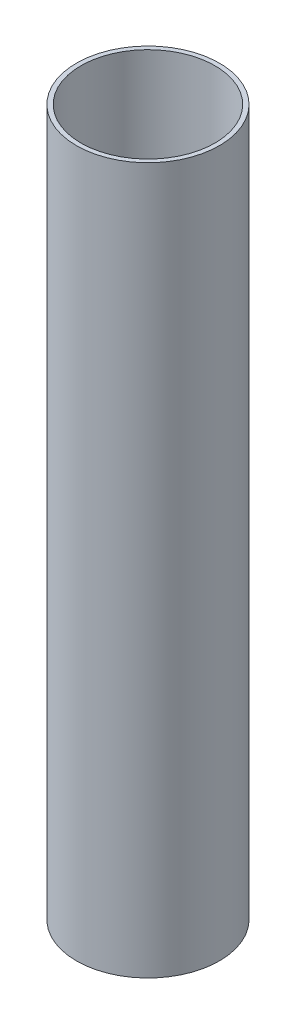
ISO-10303-21;
HEADER;
FILE_DESCRIPTION(('STEP AP214'),'2;1');
FILE_NAME('part.step','',(''),(''),'','','');
FILE_SCHEMA(('AUTOMOTIVE_DESIGN { 1 0 10303 214 1 1 1 1 }'));
ENDSEC;
DATA;
#1=APPLICATION_CONTEXT('core data for automotive mechanical design processes');
#2=APPLICATION_PROTOCOL_DEFINITION('international standard','automotive_design',2000,#1);
#3=PRODUCT_CONTEXT('',#1,'mechanical');
#4=PRODUCT('Part','Part','',(#3));
#5=PRODUCT_RELATED_PRODUCT_CATEGORY('part','',(#4));
#6=PRODUCT_DEFINITION_FORMATION('','',#4);
#7=PRODUCT_DEFINITION_CONTEXT('part definition',#1,'design');
#8=PRODUCT_DEFINITION('design','',#6,#7);
#9=PRODUCT_DEFINITION_SHAPE('','',#8);
#10=(LENGTH_UNIT() NAMED_UNIT(*) SI_UNIT(.MILLI.,.METRE.));
#11=(NAMED_UNIT(*) PLANE_ANGLE_UNIT() SI_UNIT($,.RADIAN.));
#12=(NAMED_UNIT(*) SI_UNIT($,.STERADIAN.) SOLID_ANGLE_UNIT());
#13=UNCERTAINTY_MEASURE_WITH_UNIT(LENGTH_MEASURE(1.E-05),#10,'distance_accuracy_value','');
#14=(GEOMETRIC_REPRESENTATION_CONTEXT(3) GLOBAL_UNCERTAINTY_ASSIGNED_CONTEXT((#13)) GLOBAL_UNIT_ASSIGNED_CONTEXT((#10,
#11,#12)) REPRESENTATION_CONTEXT('',''));
#15=CARTESIAN_POINT('',(0.,0.,0.));
#16=DIRECTION('',(0.,0.,1.));
#17=DIRECTION('',(1.,0.,0.));
#18=AXIS2_PLACEMENT_3D('',#15,#16,#17);
#19=CARTESIAN_POINT('',(0.,-501.65,0.));
#20=DIRECTION('',(0.,1.,0.));
#21=DIRECTION('',(0.,0.,1.));
#22=AXIS2_PLACEMENT_3D('',#19,#20,#21);
#23=CYLINDRICAL_SURFACE('',#22,50.8);
#24=CARTESIAN_POINT('',(0.,-501.65,0.));
#25=DIRECTION('',(0.,1.,0.));
#26=DIRECTION('',(0.,0.,1.));
#27=AXIS2_PLACEMENT_3D('',#24,#25,#26);
#28=CIRCLE('',#27,50.8);
#29=CARTESIAN_POINT('',(0.,-501.65,50.8));
#30=VERTEX_POINT('',#29);
#31=EDGE_CURVE('E10',#30,#30,#28,.T.);
#32=ORIENTED_EDGE('',*,*,#31,.T.);
#33=EDGE_LOOP('',(#32));
#34=FACE_BOUND('',#33,.T.);
#35=CARTESIAN_POINT('',(0.,0.,0.));
#36=DIRECTION('',(0.,1.,0.));
#37=DIRECTION('',(0.,0.,1.));
#38=AXIS2_PLACEMENT_3D('',#35,#36,#37);
#39=CIRCLE('',#38,50.8);
#40=CARTESIAN_POINT('',(0.,0.,50.8));
#41=VERTEX_POINT('',#40);
#42=EDGE_CURVE('E36',#41,#41,#39,.T.);
#43=ORIENTED_EDGE('',*,*,#42,.F.);
#44=EDGE_LOOP('',(#43));
#45=FACE_BOUND('',#44,.T.);
#46=ADVANCED_FACE('F30',(#34,#45),#23,.T.);
#47=CARTESIAN_POINT('',(0.,-501.65,0.));
#48=DIRECTION('',(0.,1.,0.));
#49=DIRECTION('',(0.,0.,1.));
#50=AXIS2_PLACEMENT_3D('',#47,#48,#49);
#51=PLANE('',#50);
#52=CARTESIAN_POINT('',(0.,-501.65,0.));
#53=DIRECTION('',(0.,1.,0.));
#54=DIRECTION('',(0.,0.,1.));
#55=AXIS2_PLACEMENT_3D('',#52,#53,#54);
#56=CIRCLE('',#55,47.625);
#57=CARTESIAN_POINT('',(0.,-501.65,47.625));
#58=VERTEX_POINT('',#57);
#59=EDGE_CURVE('E40',#58,#58,#56,.T.);
#60=ORIENTED_EDGE('',*,*,#59,.T.);
#61=EDGE_LOOP('',(#60));
#62=FACE_BOUND('',#61,.T.);
#63=ORIENTED_EDGE('',*,*,#31,.F.);
#64=EDGE_LOOP('',(#63));
#65=FACE_BOUND('',#64,.T.);
#66=ADVANCED_FACE('F54',(#62,#65),#51,.F.);
#67=CARTESIAN_POINT('',(0.,0.,0.));
#68=DIRECTION('',(0.,1.,0.));
#69=DIRECTION('',(0.,0.,1.));
#70=AXIS2_PLACEMENT_3D('',#67,#68,#69);
#71=PLANE('',#70);
#72=CARTESIAN_POINT('',(0.,0.,0.));
#73=DIRECTION('',(0.,1.,0.));
#74=DIRECTION('',(0.,0.,1.));
#75=AXIS2_PLACEMENT_3D('',#72,#73,#74);
#76=CIRCLE('',#75,47.625);
#77=CARTESIAN_POINT('',(0.,0.,47.625));
#78=VERTEX_POINT('',#77);
#79=EDGE_CURVE('E44',#78,#78,#76,.T.);
#80=ORIENTED_EDGE('',*,*,#79,.F.);
#81=EDGE_LOOP('',(#80));
#82=FACE_BOUND('',#81,.T.);
#83=ORIENTED_EDGE('',*,*,#42,.T.);
#84=EDGE_LOOP('',(#83));
#85=FACE_BOUND('',#84,.T.);
#86=ADVANCED_FACE('F52',(#82,#85),#71,.T.);
#87=CARTESIAN_POINT('',(0.,-501.65,0.));
#88=DIRECTION('',(0.,1.,0.));
#89=DIRECTION('',(0.,0.,1.));
#90=AXIS2_PLACEMENT_3D('',#87,#88,#89);
#91=CYLINDRICAL_SURFACE('',#90,47.625);
#92=ORIENTED_EDGE('',*,*,#59,.F.);
#93=EDGE_LOOP('',(#92));
#94=FACE_BOUND('',#93,.T.);
#95=ORIENTED_EDGE('',*,*,#79,.T.);
#96=EDGE_LOOP('',(#95));
#97=FACE_BOUND('',#96,.T.);
#98=ADVANCED_FACE('F50',(#94,#97),#91,.F.);
#99=CLOSED_SHELL('',(#46,#66,#86,#98));
#100=MANIFOLD_SOLID_BREP('B2',#99);
#101=ADVANCED_BREP_SHAPE_REPRESENTATION('',(#18,#100),#14);
#102=SHAPE_DEFINITION_REPRESENTATION(#9,#101);
ENDSEC;
END-ISO-10303-21;
